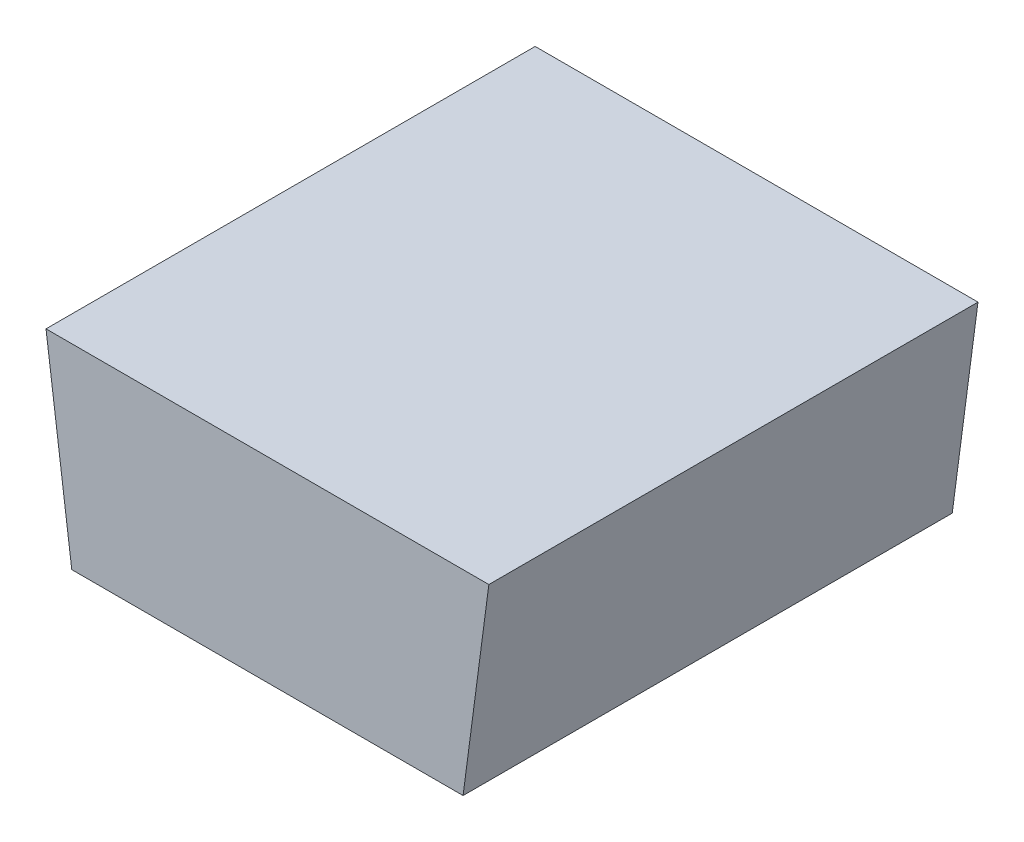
ISO-10303-21;
HEADER;
FILE_DESCRIPTION(('STEP AP214'),'2;1');
FILE_NAME('part.step','',(''),(''),'','','');
FILE_SCHEMA(('AUTOMOTIVE_DESIGN { 1 0 10303 214 1 1 1 1 }'));
ENDSEC;
DATA;
#1=APPLICATION_CONTEXT('core data for automotive mechanical design processes');
#2=APPLICATION_PROTOCOL_DEFINITION('international standard','automotive_design',2000,#1);
#3=PRODUCT_CONTEXT('',#1,'mechanical');
#4=PRODUCT('Part','Part','',(#3));
#5=PRODUCT_RELATED_PRODUCT_CATEGORY('part','',(#4));
#6=PRODUCT_DEFINITION_FORMATION('','',#4);
#7=PRODUCT_DEFINITION_CONTEXT('part definition',#1,'design');
#8=PRODUCT_DEFINITION('design','',#6,#7);
#9=PRODUCT_DEFINITION_SHAPE('','',#8);
#10=(LENGTH_UNIT() NAMED_UNIT(*) SI_UNIT(.MILLI.,.METRE.));
#11=(NAMED_UNIT(*) PLANE_ANGLE_UNIT() SI_UNIT($,.RADIAN.));
#12=(NAMED_UNIT(*) SI_UNIT($,.STERADIAN.) SOLID_ANGLE_UNIT());
#13=UNCERTAINTY_MEASURE_WITH_UNIT(LENGTH_MEASURE(1.E-05),#10,'distance_accuracy_value','');
#14=(GEOMETRIC_REPRESENTATION_CONTEXT(3) GLOBAL_UNCERTAINTY_ASSIGNED_CONTEXT((#13)) GLOBAL_UNIT_ASSIGNED_CONTEXT((#10,
#11,#12)) REPRESENTATION_CONTEXT('',''));
#15=CARTESIAN_POINT('',(0.,0.,0.));
#16=DIRECTION('',(0.,0.,1.));
#17=DIRECTION('',(1.,0.,0.));
#18=AXIS2_PLACEMENT_3D('',#15,#16,#17);
#19=CARTESIAN_POINT('',(20.,0.,50.));
#20=DIRECTION('',(-0.991444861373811,0.130526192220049,0.));
#21=DIRECTION('',(-0.130526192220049,-0.991444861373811,0.));
#22=AXIS2_PLACEMENT_3D('',#19,#20,#21);
#23=PLANE('',#22);
#24=DIRECTION('',(0.130526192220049,0.991444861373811,0.));
#25=VECTOR('',#24,1.);
#26=CARTESIAN_POINT('',(20.,0.,0.));
#27=LINE('',#26,#25);
#28=CARTESIAN_POINT('',(20.,0.,0.));
#29=VERTEX_POINT('',#28);
#30=CARTESIAN_POINT('',(22.6330499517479,20.,0.));
#31=VERTEX_POINT('',#30);
#32=EDGE_CURVE('E70',#29,#31,#27,.T.);
#33=ORIENTED_EDGE('',*,*,#32,.T.);
#34=DIRECTION('',(0.,0.,-1.));
#35=VECTOR('',#34,1.);
#36=CARTESIAN_POINT('',(22.6330499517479,20.,50.));
#37=LINE('',#36,#35);
#38=CARTESIAN_POINT('',(22.6330499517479,20.,50.));
#39=VERTEX_POINT('',#38);
#40=EDGE_CURVE('E11',#39,#31,#37,.T.);
#41=ORIENTED_EDGE('',*,*,#40,.F.);
#42=DIRECTION('',(0.130526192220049,0.991444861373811,0.));
#43=VECTOR('',#42,1.);
#44=CARTESIAN_POINT('',(20.,0.,50.));
#45=LINE('',#44,#43);
#46=CARTESIAN_POINT('',(20.,0.,50.));
#47=VERTEX_POINT('',#46);
#48=EDGE_CURVE('E88',#47,#39,#45,.T.);
#49=ORIENTED_EDGE('',*,*,#48,.F.);
#50=DIRECTION('',(0.,0.,-1.));
#51=VECTOR('',#50,1.);
#52=CARTESIAN_POINT('',(20.,0.,50.));
#53=LINE('',#52,#51);
#54=EDGE_CURVE('E82',#47,#29,#53,.T.);
#55=ORIENTED_EDGE('',*,*,#54,.T.);
#56=EDGE_LOOP('',(#33,#41,#49,#55));
#57=FACE_BOUND('',#56,.T.);
#58=ADVANCED_FACE('F26',(#57),#23,.F.);
#59=CARTESIAN_POINT('',(22.6330499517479,20.,50.));
#60=DIRECTION('',(0.,-1.,0.));
#61=DIRECTION('',(0.,0.,-1.));
#62=AXIS2_PLACEMENT_3D('',#59,#60,#61);
#63=PLANE('',#62);
#64=DIRECTION('',(-1.,0.,0.));
#65=VECTOR('',#64,1.);
#66=CARTESIAN_POINT('',(22.6330499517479,20.,0.));
#67=LINE('',#66,#65);
#68=CARTESIAN_POINT('',(-22.6330499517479,20.,0.));
#69=VERTEX_POINT('',#68);
#70=EDGE_CURVE('E66',#31,#69,#67,.T.);
#71=ORIENTED_EDGE('',*,*,#70,.T.);
#72=DIRECTION('',(0.,0.,-1.));
#73=VECTOR('',#72,1.);
#74=CARTESIAN_POINT('',(-22.6330499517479,20.,50.));
#75=LINE('',#74,#73);
#76=CARTESIAN_POINT('',(-22.6330499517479,20.,50.));
#77=VERTEX_POINT('',#76);
#78=EDGE_CURVE('E33',#77,#69,#75,.T.);
#79=ORIENTED_EDGE('',*,*,#78,.F.);
#80=DIRECTION('',(-1.,0.,0.));
#81=VECTOR('',#80,1.);
#82=CARTESIAN_POINT('',(22.6330499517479,20.,50.));
#83=LINE('',#82,#81);
#84=EDGE_CURVE('E78',#39,#77,#83,.T.);
#85=ORIENTED_EDGE('',*,*,#84,.F.);
#86=ORIENTED_EDGE('',*,*,#40,.T.);
#87=EDGE_LOOP('',(#71,#79,#85,#86));
#88=FACE_BOUND('',#87,.T.);
#89=ADVANCED_FACE('F77',(#88),#63,.F.);
#90=CARTESIAN_POINT('',(-20.,0.,50.));
#91=DIRECTION('',(0.991444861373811,0.130526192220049,0.));
#92=DIRECTION('',(-0.130526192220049,0.991444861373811,0.));
#93=AXIS2_PLACEMENT_3D('',#90,#91,#92);
#94=PLANE('',#93);
#95=DIRECTION('',(0.130526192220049,-0.991444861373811,0.));
#96=VECTOR('',#95,1.);
#97=CARTESIAN_POINT('',(-20.,0.,0.));
#98=LINE('',#97,#96);
#99=CARTESIAN_POINT('',(-20.,0.,0.));
#100=VERTEX_POINT('',#99);
#101=EDGE_CURVE('E71',#69,#100,#98,.T.);
#102=ORIENTED_EDGE('',*,*,#101,.T.);
#103=DIRECTION('',(0.,0.,-1.));
#104=VECTOR('',#103,1.);
#105=CARTESIAN_POINT('',(-20.,0.,50.));
#106=LINE('',#105,#104);
#107=CARTESIAN_POINT('',(-20.,0.,50.));
#108=VERTEX_POINT('',#107);
#109=EDGE_CURVE('E94',#108,#100,#106,.T.);
#110=ORIENTED_EDGE('',*,*,#109,.F.);
#111=DIRECTION('',(0.130526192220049,-0.991444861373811,0.));
#112=VECTOR('',#111,1.);
#113=CARTESIAN_POINT('',(-20.,0.,50.));
#114=LINE('',#113,#112);
#115=EDGE_CURVE('E45',#77,#108,#114,.T.);
#116=ORIENTED_EDGE('',*,*,#115,.F.);
#117=ORIENTED_EDGE('',*,*,#78,.T.);
#118=EDGE_LOOP('',(#102,#110,#116,#117));
#119=FACE_BOUND('',#118,.T.);
#120=ADVANCED_FACE('F97',(#119),#94,.F.);
#121=CARTESIAN_POINT('',(-20.,0.,50.));
#122=DIRECTION('',(0.,1.,0.));
#123=DIRECTION('',(0.,0.,1.));
#124=AXIS2_PLACEMENT_3D('',#121,#122,#123);
#125=PLANE('',#124);
#126=DIRECTION('',(1.,0.,0.));
#127=VECTOR('',#126,1.);
#128=CARTESIAN_POINT('',(-20.,0.,0.));
#129=LINE('',#128,#127);
#130=EDGE_CURVE('E86',#100,#29,#129,.T.);
#131=ORIENTED_EDGE('',*,*,#130,.T.);
#132=ORIENTED_EDGE('',*,*,#54,.F.);
#133=DIRECTION('',(1.,0.,0.));
#134=VECTOR('',#133,1.);
#135=CARTESIAN_POINT('',(-20.,0.,50.));
#136=LINE('',#135,#134);
#137=EDGE_CURVE('E40',#108,#47,#136,.T.);
#138=ORIENTED_EDGE('',*,*,#137,.F.);
#139=ORIENTED_EDGE('',*,*,#109,.T.);
#140=EDGE_LOOP('',(#131,#132,#138,#139));
#141=FACE_BOUND('',#140,.T.);
#142=ADVANCED_FACE('F99',(#141),#125,.F.);
#143=CARTESIAN_POINT('',(22.6330499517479,20.,50.));
#144=DIRECTION('',(0.,0.,1.));
#145=DIRECTION('',(1.,0.,0.));
#146=AXIS2_PLACEMENT_3D('',#143,#144,#145);
#147=PLANE('',#146);
#148=ORIENTED_EDGE('',*,*,#48,.T.);
#149=ORIENTED_EDGE('',*,*,#84,.T.);
#150=ORIENTED_EDGE('',*,*,#115,.T.);
#151=ORIENTED_EDGE('',*,*,#137,.T.);
#152=EDGE_LOOP('',(#148,#149,#150,#151));
#153=FACE_BOUND('',#152,.T.);
#154=ADVANCED_FACE('F100',(#153),#147,.T.);
#155=CARTESIAN_POINT('',(22.6330499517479,20.,0.));
#156=DIRECTION('',(0.,0.,1.));
#157=DIRECTION('',(1.,0.,0.));
#158=AXIS2_PLACEMENT_3D('',#155,#156,#157);
#159=PLANE('',#158);
#160=ORIENTED_EDGE('',*,*,#32,.F.);
#161=ORIENTED_EDGE('',*,*,#130,.F.);
#162=ORIENTED_EDGE('',*,*,#101,.F.);
#163=ORIENTED_EDGE('',*,*,#70,.F.);
#164=EDGE_LOOP('',(#160,#161,#162,#163));
#165=FACE_BOUND('',#164,.T.);
#166=ADVANCED_FACE('F67',(#165),#159,.F.);
#167=CLOSED_SHELL('',(#58,#89,#120,#142,#154,#166));
#168=MANIFOLD_SOLID_BREP('B2',#167);
#169=ADVANCED_BREP_SHAPE_REPRESENTATION('',(#18,#168),#14);
#170=SHAPE_DEFINITION_REPRESENTATION(#9,#169);
ENDSEC;
END-ISO-10303-21;
